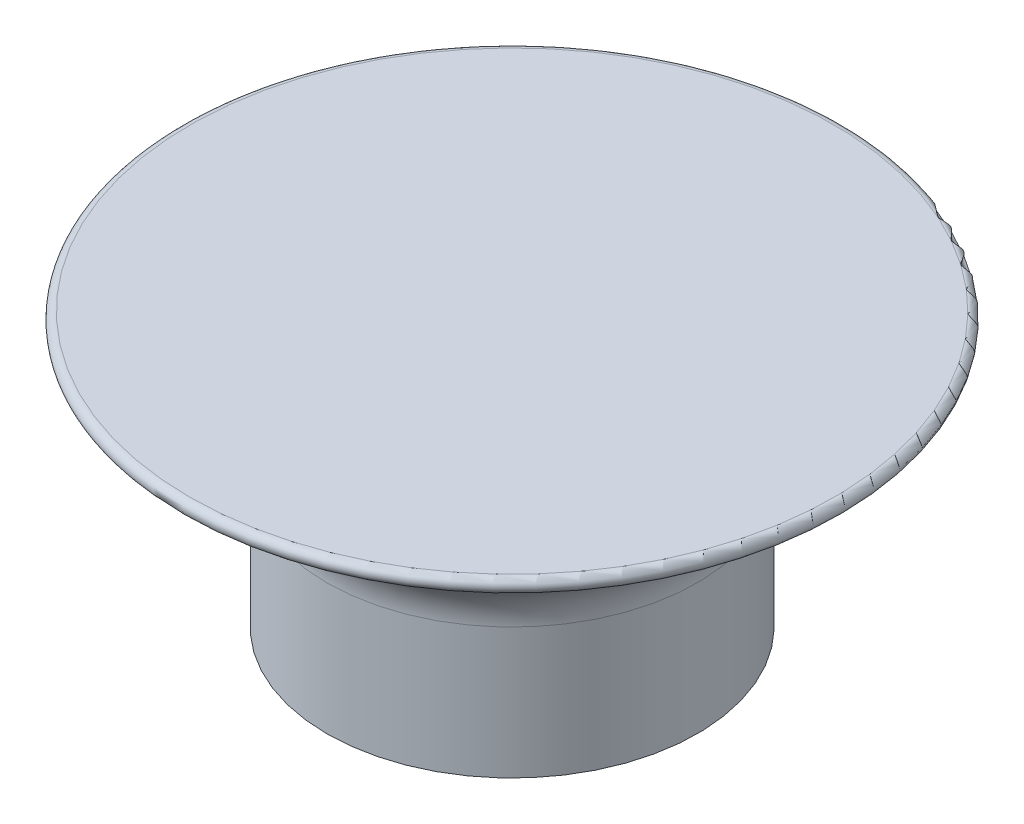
ISO-10303-21;
HEADER;
FILE_DESCRIPTION(('STEP AP214'),'2;1');
FILE_NAME('part.step','',(''),(''),'','','');
FILE_SCHEMA(('AUTOMOTIVE_DESIGN { 1 0 10303 214 1 1 1 1 }'));
ENDSEC;
DATA;
#1=APPLICATION_CONTEXT('core data for automotive mechanical design processes');
#2=APPLICATION_PROTOCOL_DEFINITION('international standard','automotive_design',2000,#1);
#3=PRODUCT_CONTEXT('',#1,'mechanical');
#4=PRODUCT('Part','Part','',(#3));
#5=PRODUCT_RELATED_PRODUCT_CATEGORY('part','',(#4));
#6=PRODUCT_DEFINITION_FORMATION('','',#4);
#7=PRODUCT_DEFINITION_CONTEXT('part definition',#1,'design');
#8=PRODUCT_DEFINITION('design','',#6,#7);
#9=PRODUCT_DEFINITION_SHAPE('','',#8);
#10=(LENGTH_UNIT() NAMED_UNIT(*) SI_UNIT(.MILLI.,.METRE.));
#11=(NAMED_UNIT(*) PLANE_ANGLE_UNIT() SI_UNIT($,.RADIAN.));
#12=(NAMED_UNIT(*) SI_UNIT($,.STERADIAN.) SOLID_ANGLE_UNIT());
#13=UNCERTAINTY_MEASURE_WITH_UNIT(LENGTH_MEASURE(1.E-05),#10,'distance_accuracy_value','');
#14=(GEOMETRIC_REPRESENTATION_CONTEXT(3) GLOBAL_UNCERTAINTY_ASSIGNED_CONTEXT((#13)) GLOBAL_UNIT_ASSIGNED_CONTEXT((#10,
#11,#12)) REPRESENTATION_CONTEXT('',''));
#15=CARTESIAN_POINT('',(0.,0.,0.));
#16=DIRECTION('',(0.,0.,1.));
#17=DIRECTION('',(1.,0.,0.));
#18=AXIS2_PLACEMENT_3D('',#15,#16,#17);
#19=CARTESIAN_POINT('',(0.,0.,0.));
#20=DIRECTION('',(0.,1.,0.));
#21=DIRECTION('',(0.,0.,1.));
#22=AXIS2_PLACEMENT_3D('',#19,#20,#21);
#23=PLANE('',#22);
#24=CARTESIAN_POINT('',(0.,0.,0.));
#25=DIRECTION('',(0.,1.,0.));
#26=DIRECTION('',(0.,0.,1.));
#27=AXIS2_PLACEMENT_3D('',#24,#25,#26);
#28=CIRCLE('',#27,7.747);
#29=CARTESIAN_POINT('',(0.,0.,7.747));
#30=VERTEX_POINT('',#29);
#31=EDGE_CURVE('E56',#30,#30,#28,.T.);
#32=ORIENTED_EDGE('',*,*,#31,.F.);
#33=EDGE_LOOP('',(#32));
#34=FACE_BOUND('',#33,.T.);
#35=CARTESIAN_POINT('',(0.,0.,0.));
#36=DIRECTION('',(0.,1.,0.));
#37=DIRECTION('',(0.,0.,1.));
#38=AXIS2_PLACEMENT_3D('',#35,#36,#37);
#39=CIRCLE('',#38,3.937);
#40=CARTESIAN_POINT('',(0.,0.,3.937));
#41=VERTEX_POINT('',#40);
#42=EDGE_CURVE('E59',#41,#41,#39,.T.);
#43=ORIENTED_EDGE('',*,*,#42,.T.);
#44=EDGE_LOOP('',(#43));
#45=FACE_BOUND('',#44,.T.);
#46=ADVANCED_FACE('F36',(#34,#45),#23,.F.);
#47=CARTESIAN_POINT('',(0.,6.35,0.));
#48=DIRECTION('',(0.,-1.,0.));
#49=DIRECTION('',(0.,0.,-1.));
#50=AXIS2_PLACEMENT_3D('',#47,#48,#49);
#51=CYLINDRICAL_SURFACE('',#50,7.747);
#52=CARTESIAN_POINT('',(0.,5.46656849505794,0.));
#53=DIRECTION('',(0.,1.,0.));
#54=DIRECTION('',(0.,0.,1.));
#55=AXIS2_PLACEMENT_3D('',#52,#53,#54);
#56=CIRCLE('',#55,7.747);
#57=CARTESIAN_POINT('',(0.,5.46656849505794,7.747));
#58=VERTEX_POINT('',#57);
#59=EDGE_CURVE('E11',#58,#58,#56,.F.);
#60=ORIENTED_EDGE('',*,*,#59,.T.);
#61=EDGE_LOOP('',(#60));
#62=FACE_BOUND('',#61,.T.);
#63=ORIENTED_EDGE('',*,*,#31,.T.);
#64=EDGE_LOOP('',(#63));
#65=FACE_BOUND('',#64,.T.);
#66=ADVANCED_FACE('F80',(#62,#65),#51,.T.);
#67=CARTESIAN_POINT('',(0.,6.35,0.));
#68=DIRECTION('',(0.,-1.,0.));
#69=DIRECTION('',(0.,0.,-1.));
#70=AXIS2_PLACEMENT_3D('',#67,#68,#69);
#71=CYLINDRICAL_SURFACE('',#70,3.937);
#72=CARTESIAN_POINT('',(0.,6.35,0.));
#73=DIRECTION('',(0.,1.,0.));
#74=DIRECTION('',(0.,0.,1.));
#75=AXIS2_PLACEMENT_3D('',#72,#73,#74);
#76=CIRCLE('',#75,3.937);
#77=CARTESIAN_POINT('',(0.,6.35,3.937));
#78=VERTEX_POINT('',#77);
#79=EDGE_CURVE('E62',#78,#78,#76,.T.);
#80=ORIENTED_EDGE('',*,*,#79,.T.);
#81=EDGE_LOOP('',(#80));
#82=FACE_BOUND('',#81,.T.);
#83=ORIENTED_EDGE('',*,*,#42,.F.);
#84=EDGE_LOOP('',(#83));
#85=FACE_BOUND('',#84,.T.);
#86=ADVANCED_FACE('F66',(#82,#85),#71,.F.);
#87=CARTESIAN_POINT('',(0.,6.35,0.));
#88=DIRECTION('',(0.,1.,0.));
#89=DIRECTION('',(0.,0.,1.));
#90=AXIS2_PLACEMENT_3D('',#87,#88,#89);
#91=PLANE('',#90);
#92=ORIENTED_EDGE('',*,*,#79,.F.);
#93=EDGE_LOOP('',(#92));
#94=FACE_BOUND('',#93,.T.);
#95=ADVANCED_FACE('F69',(#94),#91,.F.);
#96=CARTESIAN_POINT('',(0.,11.43,0.));
#97=DIRECTION('',(0.,1.,0.));
#98=DIRECTION('',(0.,0.,1.));
#99=AXIS2_PLACEMENT_3D('',#96,#97,#98);
#100=PLANE('',#99);
#101=CARTESIAN_POINT('',(0.,11.43,0.));
#102=DIRECTION('',(0.,1.,0.));
#103=DIRECTION('',(0.,0.,1.));
#104=AXIS2_PLACEMENT_3D('',#101,#102,#103);
#105=CIRCLE('',#104,13.475286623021);
#106=CARTESIAN_POINT('',(0.,11.43,13.475286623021));
#107=VERTEX_POINT('',#106);
#108=EDGE_CURVE('E51',#107,#107,#105,.T.);
#109=ORIENTED_EDGE('',*,*,#108,.T.);
#110=EDGE_LOOP('',(#109));
#111=FACE_BOUND('',#110,.T.);
#112=ADVANCED_FACE('F71',(#111),#100,.T.);
#113=CARTESIAN_POINT('',(-6.20355431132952,6.35,4.64025030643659));
#114=CARTESIAN_POINT('',(-2.86279328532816,11.43,14.3216772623));
#115=CARTESIAN_POINT('',(3.07694630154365,6.35,17.0473589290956));
#116=CARTESIAN_POINT('',(25.7805612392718,11.43,20.0472638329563));
#117=CARTESIAN_POINT('',(15.4840549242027,6.35,7.76685831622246));
#118=CARTESIAN_POINT('',(31.5061478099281,11.43,-8.59609069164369));
#119=CARTESIAN_POINT('',(6.20355431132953,6.35,-4.64025030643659));
#120=CARTESIAN_POINT('',(2.86279328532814,11.43,-14.3216772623));
#121=CARTESIAN_POINT('',(-3.07694630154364,6.35,-17.0473589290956));
#122=CARTESIAN_POINT('',(-25.7805612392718,11.43,-20.0472638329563));
#123=CARTESIAN_POINT('',(-15.4840549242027,6.35,-7.76685831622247));
#124=CARTESIAN_POINT('',(-31.5061478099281,11.43,8.59609069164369));
#125=CARTESIAN_POINT('',(-6.20355431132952,6.35,4.64025030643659));
#126=CARTESIAN_POINT('',(-2.86279328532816,11.43,14.3216772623));
#127=(BOUNDED_SURFACE() B_SPLINE_SURFACE(3,1,((#113,#114),(#115,#116),(#117,#118),(#119,#120),
(#121,#122),(#123,#124),(#125,#126)),.UNSPECIFIED.,.T.,.F.,.F.) B_SPLINE_SURFACE_WITH_KNOTS((4,
3,4),(2,2),(0.,0.5,1.),(0.,1.),
.UNSPECIFIED.) GEOMETRIC_REPRESENTATION_ITEM() RATIONAL_B_SPLINE_SURFACE(((1.,1.),
(0.333333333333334,0.333333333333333),(0.333333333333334,0.333333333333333),(1.,1.),
(0.333333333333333,0.333333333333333),(0.333333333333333,0.333333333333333),(1.,1.))) REPRESENTATION_ITEM('') SURFACE());
#128=CARTESIAN_POINT('',(0.,7.25981107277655,0.));
#129=DIRECTION('',(0.,1.,0.));
#130=DIRECTION('',(0.,0.,1.));
#131=AXIS2_PLACEMENT_3D('',#128,#129,#130);
#132=CIRCLE('',#131,8.48814451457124);
#133=CARTESIAN_POINT('',(-5.60523514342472,7.25981107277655,6.37416161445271));
#134=VERTEX_POINT('',#133);
#135=EDGE_CURVE('E43',#134,#134,#132,.T.);
#136=CARTESIAN_POINT('',(0.,10.8626744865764,0.));
#137=DIRECTION('',(0.,1.,0.));
#138=DIRECTION('',(0.,0.,1.));
#139=AXIS2_PLACEMENT_3D('',#136,#137,#138);
#140=CIRCLE('',#139,13.630152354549);
#141=CARTESIAN_POINT('',(-3.23588363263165,10.8626744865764,13.2404724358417));
#142=VERTEX_POINT('',#141);
#143=EDGE_CURVE('E47',#142,#142,#140,.F.);
#144=CARTESIAN_POINT('',(-5.60523514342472,7.25981107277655,6.37416161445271));
#145=CARTESIAN_POINT('',(-5.58055439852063,7.29734090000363,6.44568568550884));
#146=CARTESIAN_POINT('',(-5.55587365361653,7.33487072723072,6.51720975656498));
#147=CARTESIAN_POINT('',(-5.50651216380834,7.40993038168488,6.66025789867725));
#148=CARTESIAN_POINT('',(-5.48183141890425,7.44746020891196,6.73178196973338));
#149=CARTESIAN_POINT('',(-5.43246992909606,7.52251986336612,6.87483011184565));
#150=CARTESIAN_POINT('',(-5.40778918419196,7.56004969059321,6.94635418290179));
#151=CARTESIAN_POINT('',(-5.35842769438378,7.63510934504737,7.08940232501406));
#152=CARTESIAN_POINT('',(-5.33374694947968,7.67263917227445,7.1609263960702));
#153=CARTESIAN_POINT('',(-5.28438545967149,7.74769882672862,7.30397453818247));
#154=CARTESIAN_POINT('',(-5.2597047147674,7.7852286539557,7.3754986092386));
#155=CARTESIAN_POINT('',(-5.21034322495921,7.86028830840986,7.51854675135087));
#156=CARTESIAN_POINT('',(-5.18566248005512,7.89781813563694,7.59007082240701));
#157=CARTESIAN_POINT('',(-5.13630099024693,7.9728777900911,7.73311896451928));
#158=CARTESIAN_POINT('',(-5.11162024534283,8.01040761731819,7.80464303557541));
#159=CARTESIAN_POINT('',(-5.06225875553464,8.08546727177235,7.94769117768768));
#160=CARTESIAN_POINT('',(-5.03757801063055,8.12299709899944,8.01921524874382));
#161=CARTESIAN_POINT('',(-4.98821652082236,8.1980567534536,8.16226339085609));
#162=CARTESIAN_POINT('',(-4.96353577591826,8.23558658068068,8.23378746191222));
#163=CARTESIAN_POINT('',(-4.91417428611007,8.31064623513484,8.37683560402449));
#164=CARTESIAN_POINT('',(-4.88949354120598,8.34817606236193,8.44835967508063));
#165=CARTESIAN_POINT('',(-4.84013205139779,8.42323571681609,8.59140781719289));
#166=CARTESIAN_POINT('',(-4.8154513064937,8.46076554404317,8.66293188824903));
#167=CARTESIAN_POINT('',(-4.76608981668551,8.53582519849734,8.8059800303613));
#168=CARTESIAN_POINT('',(-4.74140907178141,8.57335502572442,8.87750410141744));
#169=CARTESIAN_POINT('',(-4.69204758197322,8.64841468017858,9.02055224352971));
#170=CARTESIAN_POINT('',(-4.66736683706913,8.68594450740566,9.09207631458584));
#171=CARTESIAN_POINT('',(-4.61800534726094,8.76100416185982,9.23512445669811));
#172=CARTESIAN_POINT('',(-4.59332460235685,8.79853398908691,9.30664852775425));
#173=CARTESIAN_POINT('',(-4.54396311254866,8.87359364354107,9.44969666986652));
#174=CARTESIAN_POINT('',(-4.51928236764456,8.91112347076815,9.52122074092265));
#175=CARTESIAN_POINT('',(-4.46992087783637,8.98618312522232,9.66426888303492));
#176=CARTESIAN_POINT('',(-4.44524013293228,9.0237129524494,9.73579295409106));
#177=CARTESIAN_POINT('',(-4.39587864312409,9.09877260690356,9.87884109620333));
#178=CARTESIAN_POINT('',(-4.37119789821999,9.13630243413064,9.95036516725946));
#179=CARTESIAN_POINT('',(-4.32183640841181,9.21136208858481,10.0934133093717));
#180=CARTESIAN_POINT('',(-4.29715566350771,9.24889191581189,10.1649373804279));
#181=CARTESIAN_POINT('',(-4.24779417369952,9.32395157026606,10.3079855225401));
#182=CARTESIAN_POINT('',(-4.22311342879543,9.36148139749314,10.3795095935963));
#183=CARTESIAN_POINT('',(-4.17375193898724,9.4365410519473,10.5225577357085));
#184=CARTESIAN_POINT('',(-4.14907119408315,9.47407087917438,10.5940818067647));
#185=CARTESIAN_POINT('',(-4.09970970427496,9.54913053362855,10.7371299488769));
#186=CARTESIAN_POINT('',(-4.07502895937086,9.58666036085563,10.8086540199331));
#187=CARTESIAN_POINT('',(-4.02566746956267,9.66172001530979,10.9517021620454));
#188=CARTESIAN_POINT('',(-4.00098672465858,9.69924984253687,11.0232262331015));
#189=CARTESIAN_POINT('',(-3.95162523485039,9.77430949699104,11.1662743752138));
#190=CARTESIAN_POINT('',(-3.92694448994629,9.81183932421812,11.2377984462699));
#191=CARTESIAN_POINT('',(-3.87758300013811,9.88689897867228,11.3808465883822));
#192=CARTESIAN_POINT('',(-3.85290225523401,9.92442880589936,11.4523706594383));
#193=CARTESIAN_POINT('',(-3.80354076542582,9.99948846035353,11.5954188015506));
#194=CARTESIAN_POINT('',(-3.77886002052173,10.0370182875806,11.6669428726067));
#195=CARTESIAN_POINT('',(-3.72949853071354,10.1120779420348,11.809991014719));
#196=CARTESIAN_POINT('',(-3.70481778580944,10.1496077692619,11.8815150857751));
#197=CARTESIAN_POINT('',(-3.65545629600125,10.224667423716,12.0245632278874));
#198=CARTESIAN_POINT('',(-3.63077555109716,10.2621972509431,12.0960872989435));
#199=CARTESIAN_POINT('',(-3.58141406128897,10.3372569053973,12.2391354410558));
#200=CARTESIAN_POINT('',(-3.55673331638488,10.3747867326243,12.3106595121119));
#201=CARTESIAN_POINT('',(-3.50737182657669,10.4498463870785,12.4537076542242));
#202=CARTESIAN_POINT('',(-3.48269108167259,10.4873762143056,12.5252317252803));
#203=CARTESIAN_POINT('',(-3.4333295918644,10.5624358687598,12.6682798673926));
#204=CARTESIAN_POINT('',(-3.40864884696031,10.5999656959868,12.7398039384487));
#205=CARTESIAN_POINT('',(-3.35928735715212,10.675025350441,12.882852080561));
#206=CARTESIAN_POINT('',(-3.33460661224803,10.7125551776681,12.9543761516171));
#207=CARTESIAN_POINT('',(-3.28524512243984,10.7876148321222,13.0974242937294));
#208=CARTESIAN_POINT('',(-3.26056437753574,10.8251446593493,13.1689483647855));
#209=CARTESIAN_POINT('',(-3.23588363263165,10.8626744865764,13.2404724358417));
#210=B_SPLINE_CURVE_WITH_KNOTS('',3,(#144,#145,#146,#147,#148,#149,#150,#151,#152,#153,#154,
#155,#156,#157,#158,#159,#160,#161,#162,#163,#164,#165,#166,#167,#168,#169,#170,#171,#172,#173,
#174,#175,#176,#177,#178,#179,#180,#181,#182,#183,#184,#185,#186,#187,#188,#189,#190,#191,#192,
#193,#194,#195,#196,#197,#198,#199,#200,#201,#202,#203,#204,#205,#206,#207,#208,#209),
.UNSPECIFIED.,.F.,.F.,(4,2,2,2,2,2,2,2,2,2,2,2,2,2,2,2,2,2,2,2,2,2,2,2,2,2,2,2,2,2,2,2,4),(0.,
0.253376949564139,0.506753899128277,0.760130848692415,1.01350779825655,1.26688474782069,
1.52026169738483,1.77363864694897,2.02701559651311,2.28039254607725,2.53376949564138,
2.78714644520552,3.04052339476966,3.2939003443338,3.54727729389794,3.80065424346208,
4.05403119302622,4.30740814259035,4.56078509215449,4.81416204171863,5.06753899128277,
5.32091594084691,5.57429289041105,5.82766983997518,6.08104678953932,6.33442373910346,
6.5878006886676,6.84117763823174,7.09455458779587,7.34793153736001,7.60130848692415,
7.85468543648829,8.10806238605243),.UNSPECIFIED.);
#211=EDGE_CURVE('BSEAM77',#134,#142,#210,.T.);
#212=ORIENTED_EDGE('',*,*,#135,.T.);
#213=ORIENTED_EDGE('',*,*,#143,.T.);
#214=ORIENTED_EDGE('',*,*,#211,.T.);
#215=ORIENTED_EDGE('',*,*,#211,.F.);
#216=EDGE_LOOP('',(#212,#214,#213,#215));
#217=FACE_BOUND('',#216,.T.);
#218=ADVANCED_FACE('F77',(#217),#127,.T.);
#219=CARTESIAN_POINT('',(0.,11.1252,0.));
#220=DIRECTION('',(0.,1.,0.));
#221=DIRECTION('',(0.,0.,1.));
#222=AXIS2_PLACEMENT_3D('',#219,#220,#221);
#223=TOROIDAL_SURFACE('',#222,13.475286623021,0.3048);
#224=ORIENTED_EDGE('',*,*,#143,.F.);
#225=EDGE_LOOP('',(#224));
#226=FACE_BOUND('',#225,.T.);
#227=ORIENTED_EDGE('',*,*,#108,.F.);
#228=EDGE_LOOP('',(#227));
#229=FACE_BOUND('',#228,.T.);
#230=ADVANCED_FACE('F92',(#226,#229),#223,.T.);
#231=CARTESIAN_POINT('',(0.,5.46656849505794,0.));
#232=DIRECTION('',(0.,1.,0.));
#233=DIRECTION('',(0.,0.,1.));
#234=AXIS2_PLACEMENT_3D('',#231,#232,#233);
#235=TOROIDAL_SURFACE('',#234,10.287,2.54);
#236=ORIENTED_EDGE('',*,*,#59,.F.);
#237=EDGE_LOOP('',(#236));
#238=FACE_BOUND('',#237,.T.);
#239=ORIENTED_EDGE('',*,*,#135,.F.);
#240=EDGE_LOOP('',(#239));
#241=FACE_BOUND('',#240,.T.);
#242=ADVANCED_FACE('F38',(#238,#241),#235,.F.);
#243=CLOSED_SHELL('',(#46,#66,#86,#95,#112,#218,#230,#242));
#244=MANIFOLD_SOLID_BREP('B2',#243);
#245=ADVANCED_BREP_SHAPE_REPRESENTATION('',(#18,#244),#14);
#246=SHAPE_DEFINITION_REPRESENTATION(#9,#245);
ENDSEC;
END-ISO-10303-21;
